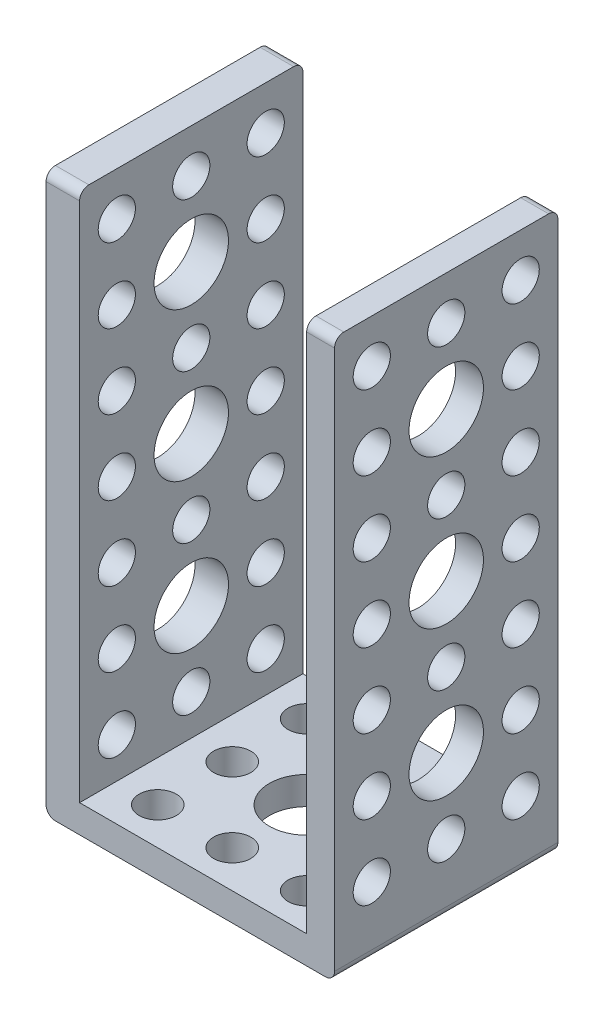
from build123d import *

# Parameters (mm, degrees)
EXTRUDE_1_DEPTH     = 24
SKETCH_3_R          = 2
SKETCH_3_R_2        = 4
CUT_EXTRUDE_1_DEPTH = 68.643954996
SKETCH_4_R          = 2
SKETCH_4_R_2        = 4
CUT_EXTRUDE_2_DEPTH = 54.232765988
FILLET_1_R          = 1


with BuildPart() as part:
    # Sketch 1 → Extrude 1 (new body)
    with BuildSketch(Plane.XY):
        Polygon((-3.601010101, -23.98989899), (27.398989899, -23.98989899), (27.398989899, 36.01010101), (24.398989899, 36.01010101), (24.398989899, -20.98989899), (0, -20.98989899), (0, 36.01010101), (-3.601010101, 36.01010101), align=None)
    extrude(amount=EXTRUDE_1_DEPTH)

    # Sketch 3 → Cut-Extrude 1 (cut, through all)
    with BuildSketch(Plane(origin=(0, -20.98989899, 0), x_dir=(1, 0, 0), z_dir=(0, 1, 0))):
        with Locations(Location((4.398989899, -4, 0), (0, 0, 180))):
            Circle(SKETCH_3_R)
        with Locations(Location((12.398989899, -4, 0), (0, 0, 180))):
            Circle(SKETCH_3_R)
        with Locations(Location((20.398989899, -12, 0), (0, 0, 180))):
            Circle(SKETCH_3_R)
        with Locations(Location((20.398989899, -20, 0), (0, 0, 180))):
            Circle(SKETCH_3_R)
        with Locations(Location((12.398989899, -20, 0), (0, 0, 180))):
            Circle(SKETCH_3_R)
        with Locations(Location((4.398989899, -12, 0), (0, 0, 180))):
            Circle(SKETCH_3_R)
        with Locations(Location((12.398989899, -12, 0), (0, 0, 180))):
            Circle(SKETCH_3_R_2)
        with Locations(Location((20.398989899, -4, 0), (0, 0, 180))):
            Circle(SKETCH_3_R)
        with Locations(Location((4.398989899, -20, 0), (0, 0, 180))):
            Circle(SKETCH_3_R)
    extrude(amount=-CUT_EXTRUDE_1_DEPTH, mode=Mode.SUBTRACT)

    # Sketch 4 → Cut-Extrude 2 (cut, through all)
    with BuildSketch(Plane.ZY.offset(3.601010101)):
        with Locations(Location((12, 31.339504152, 0), (0, 0, 270))):
            Circle(SKETCH_4_R)
        with Locations(Location((20, 31.339504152, 0), (0, 0, 270))):
            Circle(SKETCH_4_R)
        with Locations(Location((4, 31.339504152, 0), (0, 0, 270))):
            Circle(SKETCH_4_R)
        with Locations(Location((4, 23.339504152, 0), (0, 0, 270))):
            Circle(SKETCH_4_R)
        with Locations(Location((20, 23.339504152, 0), (0, 0, 270))):
            Circle(SKETCH_4_R)
        with Locations(Location((4, 15.339504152, 0), (0, 0, 270))):
            Circle(SKETCH_4_R)
        with Locations(Location((12, 15.339504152, 0), (0, 0, 270))):
            Circle(SKETCH_4_R)
        with Locations(Location((20, 15.339504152, 0), (0, 0, 270))):
            Circle(SKETCH_4_R)
        with Locations(Location((4, 7.339504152, 0), (0, 0, 270))):
            Circle(SKETCH_4_R)
        with Locations(Location((20, 7.339504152, 0), (0, 0, 270))):
            Circle(SKETCH_4_R)
        with Locations(Location((4, -0.660495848, 0), (0, 0, 270))):
            Circle(SKETCH_4_R)
        with Locations(Location((12, -0.660495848, 0), (0, 0, 270))):
            Circle(SKETCH_4_R)
        with Locations(Location((20, -0.660495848, 0), (0, 0, 270))):
            Circle(SKETCH_4_R)
        with Locations(Location((4, -8.660495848, 0), (0, 0, 270))):
            Circle(SKETCH_4_R)
        with Locations(Location((20, -8.660495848, 0), (0, 0, 270))):
            Circle(SKETCH_4_R)
        with Locations(Location((4, -16.660495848, 0), (0, 0, 270))):
            Circle(SKETCH_4_R)
        with Locations(Location((12, -16.660495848, 0), (0, 0, 270))):
            Circle(SKETCH_4_R)
        with Locations(Location((20, -16.660495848, 0), (0, 0, 270))):
            Circle(SKETCH_4_R)
        with Locations(Location((12, 23.339504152, 0), (0, 0, 270))):
            Circle(SKETCH_4_R_2)
        with Locations(Location((12, 7.339504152, 0), (0, 0, 270))):
            Circle(SKETCH_4_R_2)
        with Locations(Location((12, -8.660495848, 0), (0, 0, 270))):
            Circle(SKETCH_4_R_2)
    extrude(amount=-CUT_EXTRUDE_2_DEPTH, mode=Mode.SUBTRACT)

    # Fillet 1
    fillet_1_edges = [part.edges().sort_by_distance(p)[0] for p in [
        (25.898989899, 36.01010101, 24),
        (27.398989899, -23.98989899, 12),
        (-3.601010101, -23.98989899, 12),
        (-1.800505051, 36.01010101, 24),
        (-1.800505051, 36.01010101, 0),
        (25.898989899, 36.01010101, 0),
    ]]
    fillet(fillet_1_edges, radius=FILLET_1_R)


solid = part.part
